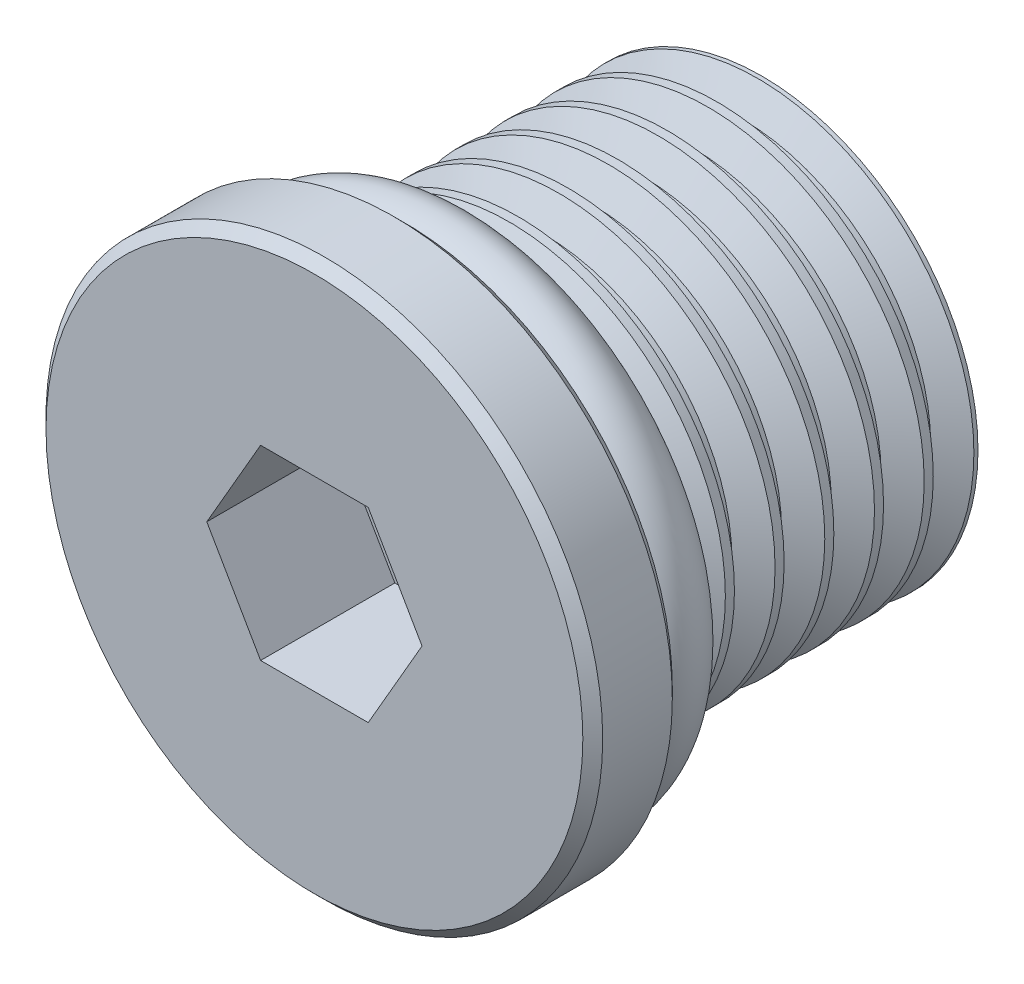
ISO-10303-21;
HEADER;
FILE_DESCRIPTION(('STEP AP214'),'2;1');
FILE_NAME('part.step','',(''),(''),'','','');
FILE_SCHEMA(('AUTOMOTIVE_DESIGN { 1 0 10303 214 1 1 1 1 }'));
ENDSEC;
DATA;
#1=APPLICATION_CONTEXT('core data for automotive mechanical design processes');
#2=APPLICATION_PROTOCOL_DEFINITION('international standard','automotive_design',2000,#1);
#3=PRODUCT_CONTEXT('',#1,'mechanical');
#4=PRODUCT('Part','Part','',(#3));
#5=PRODUCT_RELATED_PRODUCT_CATEGORY('part','',(#4));
#6=PRODUCT_DEFINITION_FORMATION('','',#4);
#7=PRODUCT_DEFINITION_CONTEXT('part definition',#1,'design');
#8=PRODUCT_DEFINITION('design','',#6,#7);
#9=PRODUCT_DEFINITION_SHAPE('','',#8);
#10=(LENGTH_UNIT() NAMED_UNIT(*) SI_UNIT(.MILLI.,.METRE.));
#11=(NAMED_UNIT(*) PLANE_ANGLE_UNIT() SI_UNIT($,.RADIAN.));
#12=(NAMED_UNIT(*) SI_UNIT($,.STERADIAN.) SOLID_ANGLE_UNIT());
#13=UNCERTAINTY_MEASURE_WITH_UNIT(LENGTH_MEASURE(1.E-05),#10,'distance_accuracy_value','');
#14=(GEOMETRIC_REPRESENTATION_CONTEXT(3) GLOBAL_UNCERTAINTY_ASSIGNED_CONTEXT((#13)) GLOBAL_UNIT_ASSIGNED_CONTEXT((#10,
#11,#12)) REPRESENTATION_CONTEXT('',''));
#15=CARTESIAN_POINT('',(0.,0.,0.));
#16=DIRECTION('',(0.,0.,1.));
#17=DIRECTION('',(1.,0.,0.));
#18=AXIS2_PLACEMENT_3D('',#15,#16,#17);
#19=CARTESIAN_POINT('',(0.,0.,-4.57199999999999));
#20=DIRECTION('',(0.,0.,1.));
#21=DIRECTION('',(1.,0.,0.));
#22=AXIS2_PLACEMENT_3D('',#19,#20,#21);
#23=CYLINDRICAL_SURFACE('',#22,4.826);
#24=CARTESIAN_POINT('',(0.,0.,-4.57199999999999));
#25=DIRECTION('',(0.,0.,-1.));
#26=DIRECTION('',(-1.,0.,0.));
#27=AXIS2_PLACEMENT_3D('',#24,#25,#26);
#28=CIRCLE('',#27,4.826);
#29=CARTESIAN_POINT('',(-4.826,0.,-4.57199999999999));
#30=VERTEX_POINT('',#29);
#31=EDGE_CURVE('E209',#30,#30,#28,.T.);
#32=ORIENTED_EDGE('',*,*,#31,.F.);
#33=EDGE_LOOP('',(#32));
#34=FACE_BOUND('',#33,.T.);
#35=CARTESIAN_POINT('',(0.,0.,-3.38902420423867));
#36=DIRECTION('',(0.,0.,1.));
#37=DIRECTION('',(1.,0.,0.));
#38=AXIS2_PLACEMENT_3D('',#35,#36,#37);
#39=CIRCLE('',#38,4.826);
#40=CARTESIAN_POINT('',(4.826,0.,-3.38902420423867));
#41=VERTEX_POINT('',#40);
#42=EDGE_CURVE('E229',#41,#41,#39,.T.);
#43=ORIENTED_EDGE('',*,*,#42,.F.);
#44=EDGE_LOOP('',(#43));
#45=FACE_BOUND('',#44,.T.);
#46=ADVANCED_FACE('F35',(#34,#45),#23,.T.);
#47=CARTESIAN_POINT('',(0.,0.,1.04119821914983));
#48=DIRECTION('',(0.,0.,1.));
#49=DIRECTION('',(1.,0.,0.));
#50=AXIS2_PLACEMENT_3D('',#47,#48,#49);
#51=CYLINDRICAL_SURFACE('',#50,5.5245);
#52=CARTESIAN_POINT('',(0.,0.,-11.325279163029));
#53=DIRECTION('',(0.,0.,1.));
#54=DIRECTION('',(1.,0.,0.));
#55=AXIS2_PLACEMENT_3D('',#52,#53,#54);
#56=CIRCLE('',#55,5.5245);
#57=CARTESIAN_POINT('',(5.5245,0.,-11.325279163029));
#58=VERTEX_POINT('',#57);
#59=EDGE_CURVE('E140',#58,#58,#56,.T.);
#60=ORIENTED_EDGE('',*,*,#59,.F.);
#61=EDGE_LOOP('',(#60));
#62=FACE_BOUND('',#61,.T.);
#63=CARTESIAN_POINT('',(0.,0.,-11.43));
#64=DIRECTION('',(0.,0.,-1.));
#65=DIRECTION('',(0.,1.,0.));
#66=AXIS2_PLACEMENT_3D('',#63,#64,#65);
#67=CIRCLE('',#66,5.5245);
#68=CARTESIAN_POINT('',(0.,5.52450000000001,-11.43));
#69=VERTEX_POINT('',#68);
#70=EDGE_CURVE('E215',#69,#69,#67,.T.);
#71=ORIENTED_EDGE('',*,*,#70,.F.);
#72=EDGE_LOOP('',(#71));
#73=FACE_BOUND('',#72,.T.);
#74=ADVANCED_FACE('F278',(#62,#73),#51,.T.);
#75=CARTESIAN_POINT('',(0.,0.,-4.97527916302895));
#76=DIRECTION('',(0.,0.,-1.));
#77=DIRECTION('',(-1.,0.,0.));
#78=AXIS2_PLACEMENT_3D('',#75,#76,#77);
#79=CONICAL_SURFACE('',#78,5.5245,1.0471975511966);
#80=ORIENTED_EDGE('',*,*,#31,.T.);
#81=EDGE_LOOP('',(#80));
#82=FACE_BOUND('',#81,.T.);
#83=CARTESIAN_POINT('',(0.,0.,-4.97527916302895));
#84=DIRECTION('',(0.,0.,1.));
#85=DIRECTION('',(1.,0.,0.));
#86=AXIS2_PLACEMENT_3D('',#83,#84,#85);
#87=CIRCLE('',#86,5.5245);
#88=CARTESIAN_POINT('',(5.52450000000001,0.,-4.97527916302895));
#89=VERTEX_POINT('',#88);
#90=EDGE_CURVE('E206',#89,#89,#87,.T.);
#91=ORIENTED_EDGE('',*,*,#90,.T.);
#92=EDGE_LOOP('',(#91));
#93=FACE_BOUND('',#92,.T.);
#94=ADVANCED_FACE('F283',(#82,#93),#79,.T.);
#95=CARTESIAN_POINT('',(0.,0.,1.04119821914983));
#96=DIRECTION('',(0.,0.,1.));
#97=DIRECTION('',(1.,0.,0.));
#98=AXIS2_PLACEMENT_3D('',#95,#96,#97);
#99=CYLINDRICAL_SURFACE('',#98,5.5245);
#100=ORIENTED_EDGE('',*,*,#90,.F.);
#101=EDGE_LOOP('',(#100));
#102=FACE_BOUND('',#101,.T.);
#103=CARTESIAN_POINT('',(0.,0.,-5.20699999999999));
#104=DIRECTION('',(0.,0.,1.));
#105=DIRECTION('',(1.,0.,0.));
#106=AXIS2_PLACEMENT_3D('',#103,#104,#105);
#107=CIRCLE('',#106,5.5245);
#108=CARTESIAN_POINT('',(5.52450000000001,0.,-5.20699999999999));
#109=VERTEX_POINT('',#108);
#110=EDGE_CURVE('E203',#109,#109,#107,.T.);
#111=ORIENTED_EDGE('',*,*,#110,.T.);
#112=EDGE_LOOP('',(#111));
#113=FACE_BOUND('',#112,.T.);
#114=ADVANCED_FACE('F385',(#102,#113),#99,.T.);
#115=CARTESIAN_POINT('',(0.,-1.11022302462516E-13,-5.61027916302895));
#116=DIRECTION('',(0.,0.,1.));
#117=DIRECTION('',(1.,0.,0.));
#118=AXIS2_PLACEMENT_3D('',#115,#116,#117);
#119=CONICAL_SURFACE('',#118,4.826,1.0471975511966);
#120=ORIENTED_EDGE('',*,*,#110,.F.);
#121=EDGE_LOOP('',(#120));
#122=FACE_BOUND('',#121,.T.);
#123=CARTESIAN_POINT('',(0.,-1.11022302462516E-13,-5.61027916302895));
#124=DIRECTION('',(0.,0.,1.));
#125=DIRECTION('',(1.,0.,0.));
#126=AXIS2_PLACEMENT_3D('',#123,#124,#125);
#127=CIRCLE('',#126,4.826);
#128=CARTESIAN_POINT('',(4.826,-1.04592778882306E-13,-5.61027916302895));
#129=VERTEX_POINT('',#128);
#130=EDGE_CURVE('E200',#129,#129,#127,.T.);
#131=ORIENTED_EDGE('',*,*,#130,.T.);
#132=EDGE_LOOP('',(#131));
#133=FACE_BOUND('',#132,.T.);
#134=ADVANCED_FACE('F382',(#122,#133),#119,.T.);
#135=CARTESIAN_POINT('',(0.,0.,1.04119821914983));
#136=DIRECTION('',(0.,0.,1.));
#137=DIRECTION('',(1.,0.,0.));
#138=AXIS2_PLACEMENT_3D('',#135,#136,#137);
#139=CYLINDRICAL_SURFACE('',#138,4.826);
#140=ORIENTED_EDGE('',*,*,#130,.F.);
#141=EDGE_LOOP('',(#140));
#142=FACE_BOUND('',#141,.T.);
#143=CARTESIAN_POINT('',(0.,-1.11022302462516E-13,-5.84199999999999));
#144=DIRECTION('',(0.,0.,1.));
#145=DIRECTION('',(1.,0.,0.));
#146=AXIS2_PLACEMENT_3D('',#143,#144,#145);
#147=CIRCLE('',#146,4.826);
#148=CARTESIAN_POINT('',(4.826,-1.04592778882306E-13,-5.84199999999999));
#149=VERTEX_POINT('',#148);
#150=EDGE_CURVE('E197',#149,#149,#147,.T.);
#151=ORIENTED_EDGE('',*,*,#150,.T.);
#152=EDGE_LOOP('',(#151));
#153=FACE_BOUND('',#152,.T.);
#154=ADVANCED_FACE('F378',(#142,#153),#139,.T.);
#155=CARTESIAN_POINT('',(0.,0.,-6.24527916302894));
#156=DIRECTION('',(0.,0.,-1.));
#157=DIRECTION('',(-1.,0.,0.));
#158=AXIS2_PLACEMENT_3D('',#155,#156,#157);
#159=CONICAL_SURFACE('',#158,5.5245,1.0471975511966);
#160=ORIENTED_EDGE('',*,*,#150,.F.);
#161=EDGE_LOOP('',(#160));
#162=FACE_BOUND('',#161,.T.);
#163=CARTESIAN_POINT('',(0.,0.,-6.24527916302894));
#164=DIRECTION('',(0.,0.,1.));
#165=DIRECTION('',(1.,0.,0.));
#166=AXIS2_PLACEMENT_3D('',#163,#164,#165);
#167=CIRCLE('',#166,5.5245);
#168=CARTESIAN_POINT('',(5.5245,0.,-6.24527916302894));
#169=VERTEX_POINT('',#168);
#170=EDGE_CURVE('E194',#169,#169,#167,.T.);
#171=ORIENTED_EDGE('',*,*,#170,.T.);
#172=EDGE_LOOP('',(#171));
#173=FACE_BOUND('',#172,.T.);
#174=ADVANCED_FACE('F374',(#162,#173),#159,.T.);
#175=CARTESIAN_POINT('',(0.,0.,1.04119821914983));
#176=DIRECTION('',(0.,0.,1.));
#177=DIRECTION('',(1.,0.,0.));
#178=AXIS2_PLACEMENT_3D('',#175,#176,#177);
#179=CYLINDRICAL_SURFACE('',#178,5.5245);
#180=ORIENTED_EDGE('',*,*,#170,.F.);
#181=EDGE_LOOP('',(#180));
#182=FACE_BOUND('',#181,.T.);
#183=CARTESIAN_POINT('',(0.,-1.11022302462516E-13,-6.47699999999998));
#184=DIRECTION('',(0.,0.,1.));
#185=DIRECTION('',(1.,0.,0.));
#186=AXIS2_PLACEMENT_3D('',#183,#184,#185);
#187=CIRCLE('',#186,5.5245);
#188=CARTESIAN_POINT('',(5.5245,-1.03662189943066E-13,-6.47699999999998));
#189=VERTEX_POINT('',#188);
#190=EDGE_CURVE('E191',#189,#189,#187,.T.);
#191=ORIENTED_EDGE('',*,*,#190,.T.);
#192=EDGE_LOOP('',(#191));
#193=FACE_BOUND('',#192,.T.);
#194=ADVANCED_FACE('F370',(#182,#193),#179,.T.);
#195=CARTESIAN_POINT('',(0.,-1.11022302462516E-13,-6.88027916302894));
#196=DIRECTION('',(0.,0.,1.));
#197=DIRECTION('',(1.,0.,0.));
#198=AXIS2_PLACEMENT_3D('',#195,#196,#197);
#199=CONICAL_SURFACE('',#198,4.826,1.0471975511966);
#200=ORIENTED_EDGE('',*,*,#190,.F.);
#201=EDGE_LOOP('',(#200));
#202=FACE_BOUND('',#201,.T.);
#203=CARTESIAN_POINT('',(0.,-1.11022302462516E-13,-6.88027916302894));
#204=DIRECTION('',(0.,0.,1.));
#205=DIRECTION('',(1.,0.,0.));
#206=AXIS2_PLACEMENT_3D('',#203,#204,#205);
#207=CIRCLE('',#206,4.826);
#208=CARTESIAN_POINT('',(4.826,-1.04592778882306E-13,-6.88027916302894));
#209=VERTEX_POINT('',#208);
#210=EDGE_CURVE('E188',#209,#209,#207,.T.);
#211=ORIENTED_EDGE('',*,*,#210,.T.);
#212=EDGE_LOOP('',(#211));
#213=FACE_BOUND('',#212,.T.);
#214=ADVANCED_FACE('F366',(#202,#213),#199,.T.);
#215=CARTESIAN_POINT('',(0.,0.,1.04119821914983));
#216=DIRECTION('',(0.,0.,1.));
#217=DIRECTION('',(1.,0.,0.));
#218=AXIS2_PLACEMENT_3D('',#215,#216,#217);
#219=CYLINDRICAL_SURFACE('',#218,4.826);
#220=ORIENTED_EDGE('',*,*,#210,.F.);
#221=EDGE_LOOP('',(#220));
#222=FACE_BOUND('',#221,.T.);
#223=CARTESIAN_POINT('',(0.,-1.11022302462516E-13,-7.11199999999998));
#224=DIRECTION('',(0.,0.,1.));
#225=DIRECTION('',(1.,0.,0.));
#226=AXIS2_PLACEMENT_3D('',#223,#224,#225);
#227=CIRCLE('',#226,4.826);
#228=CARTESIAN_POINT('',(4.826,-1.04592778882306E-13,-7.11199999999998));
#229=VERTEX_POINT('',#228);
#230=EDGE_CURVE('E185',#229,#229,#227,.T.);
#231=ORIENTED_EDGE('',*,*,#230,.T.);
#232=EDGE_LOOP('',(#231));
#233=FACE_BOUND('',#232,.T.);
#234=ADVANCED_FACE('F362',(#222,#233),#219,.T.);
#235=CARTESIAN_POINT('',(0.,-1.11022302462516E-13,-7.51527916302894));
#236=DIRECTION('',(0.,0.,-1.));
#237=DIRECTION('',(-1.,0.,0.));
#238=AXIS2_PLACEMENT_3D('',#235,#236,#237);
#239=CONICAL_SURFACE('',#238,5.5245,1.0471975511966);
#240=ORIENTED_EDGE('',*,*,#230,.F.);
#241=EDGE_LOOP('',(#240));
#242=FACE_BOUND('',#241,.T.);
#243=CARTESIAN_POINT('',(0.,-1.11022302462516E-13,-7.51527916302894));
#244=DIRECTION('',(0.,0.,1.));
#245=DIRECTION('',(1.,0.,0.));
#246=AXIS2_PLACEMENT_3D('',#243,#244,#245);
#247=CIRCLE('',#246,5.5245);
#248=CARTESIAN_POINT('',(5.5245,-1.03662189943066E-13,-7.51527916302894));
#249=VERTEX_POINT('',#248);
#250=EDGE_CURVE('E182',#249,#249,#247,.T.);
#251=ORIENTED_EDGE('',*,*,#250,.T.);
#252=EDGE_LOOP('',(#251));
#253=FACE_BOUND('',#252,.T.);
#254=ADVANCED_FACE('F358',(#242,#253),#239,.T.);
#255=CARTESIAN_POINT('',(0.,0.,1.04119821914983));
#256=DIRECTION('',(0.,0.,1.));
#257=DIRECTION('',(1.,0.,0.));
#258=AXIS2_PLACEMENT_3D('',#255,#256,#257);
#259=CYLINDRICAL_SURFACE('',#258,5.5245);
#260=ORIENTED_EDGE('',*,*,#250,.F.);
#261=EDGE_LOOP('',(#260));
#262=FACE_BOUND('',#261,.T.);
#263=CARTESIAN_POINT('',(0.,0.,-7.747));
#264=DIRECTION('',(0.,0.,1.));
#265=DIRECTION('',(1.,0.,0.));
#266=AXIS2_PLACEMENT_3D('',#263,#264,#265);
#267=CIRCLE('',#266,5.5245);
#268=CARTESIAN_POINT('',(5.5245,0.,-7.747));
#269=VERTEX_POINT('',#268);
#270=EDGE_CURVE('E179',#269,#269,#267,.T.);
#271=ORIENTED_EDGE('',*,*,#270,.T.);
#272=EDGE_LOOP('',(#271));
#273=FACE_BOUND('',#272,.T.);
#274=ADVANCED_FACE('F354',(#262,#273),#259,.T.);
#275=CARTESIAN_POINT('',(0.,0.,-8.15027916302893));
#276=DIRECTION('',(0.,0.,1.));
#277=DIRECTION('',(1.,0.,0.));
#278=AXIS2_PLACEMENT_3D('',#275,#276,#277);
#279=CONICAL_SURFACE('',#278,4.826,1.0471975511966);
#280=ORIENTED_EDGE('',*,*,#270,.F.);
#281=EDGE_LOOP('',(#280));
#282=FACE_BOUND('',#281,.T.);
#283=CARTESIAN_POINT('',(0.,0.,-8.15027916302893));
#284=DIRECTION('',(0.,0.,1.));
#285=DIRECTION('',(1.,0.,0.));
#286=AXIS2_PLACEMENT_3D('',#283,#284,#285);
#287=CIRCLE('',#286,4.826);
#288=CARTESIAN_POINT('',(4.826,0.,-8.15027916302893));
#289=VERTEX_POINT('',#288);
#290=EDGE_CURVE('E176',#289,#289,#287,.T.);
#291=ORIENTED_EDGE('',*,*,#290,.T.);
#292=EDGE_LOOP('',(#291));
#293=FACE_BOUND('',#292,.T.);
#294=ADVANCED_FACE('F350',(#282,#293),#279,.T.);
#295=CARTESIAN_POINT('',(0.,0.,1.04119821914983));
#296=DIRECTION('',(0.,0.,1.));
#297=DIRECTION('',(1.,0.,0.));
#298=AXIS2_PLACEMENT_3D('',#295,#296,#297);
#299=CYLINDRICAL_SURFACE('',#298,4.826);
#300=ORIENTED_EDGE('',*,*,#290,.F.);
#301=EDGE_LOOP('',(#300));
#302=FACE_BOUND('',#301,.T.);
#303=CARTESIAN_POINT('',(0.,0.,-8.382));
#304=DIRECTION('',(0.,0.,1.));
#305=DIRECTION('',(1.,0.,0.));
#306=AXIS2_PLACEMENT_3D('',#303,#304,#305);
#307=CIRCLE('',#306,4.82599999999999);
#308=CARTESIAN_POINT('',(4.826,0.,-8.382));
#309=VERTEX_POINT('',#308);
#310=EDGE_CURVE('E173',#309,#309,#307,.T.);
#311=ORIENTED_EDGE('',*,*,#310,.T.);
#312=EDGE_LOOP('',(#311));
#313=FACE_BOUND('',#312,.T.);
#314=ADVANCED_FACE('F346',(#302,#313),#299,.T.);
#315=CARTESIAN_POINT('',(0.,0.,-8.78527916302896));
#316=DIRECTION('',(0.,0.,-1.));
#317=DIRECTION('',(-1.,0.,0.));
#318=AXIS2_PLACEMENT_3D('',#315,#316,#317);
#319=CONICAL_SURFACE('',#318,5.5245,1.04719755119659);
#320=ORIENTED_EDGE('',*,*,#310,.F.);
#321=EDGE_LOOP('',(#320));
#322=FACE_BOUND('',#321,.T.);
#323=CARTESIAN_POINT('',(0.,0.,-8.78527916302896));
#324=DIRECTION('',(0.,0.,1.));
#325=DIRECTION('',(1.,0.,0.));
#326=AXIS2_PLACEMENT_3D('',#323,#324,#325);
#327=CIRCLE('',#326,5.5245);
#328=CARTESIAN_POINT('',(5.5245,0.,-8.78527916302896));
#329=VERTEX_POINT('',#328);
#330=EDGE_CURVE('E170',#329,#329,#327,.T.);
#331=ORIENTED_EDGE('',*,*,#330,.T.);
#332=EDGE_LOOP('',(#331));
#333=FACE_BOUND('',#332,.T.);
#334=ADVANCED_FACE('F342',(#322,#333),#319,.T.);
#335=CARTESIAN_POINT('',(0.,0.,1.04119821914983));
#336=DIRECTION('',(0.,0.,1.));
#337=DIRECTION('',(1.,0.,0.));
#338=AXIS2_PLACEMENT_3D('',#335,#336,#337);
#339=CYLINDRICAL_SURFACE('',#338,5.5245);
#340=ORIENTED_EDGE('',*,*,#330,.F.);
#341=EDGE_LOOP('',(#340));
#342=FACE_BOUND('',#341,.T.);
#343=CARTESIAN_POINT('',(0.,0.,-9.017));
#344=DIRECTION('',(0.,0.,1.));
#345=DIRECTION('',(1.,0.,0.));
#346=AXIS2_PLACEMENT_3D('',#343,#344,#345);
#347=CIRCLE('',#346,5.5245);
#348=CARTESIAN_POINT('',(5.5245,0.,-9.017));
#349=VERTEX_POINT('',#348);
#350=EDGE_CURVE('E167',#349,#349,#347,.T.);
#351=ORIENTED_EDGE('',*,*,#350,.T.);
#352=EDGE_LOOP('',(#351));
#353=FACE_BOUND('',#352,.T.);
#354=ADVANCED_FACE('F338',(#342,#353),#339,.T.);
#355=CARTESIAN_POINT('',(0.,0.,-9.42027916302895));
#356=DIRECTION('',(0.,0.,1.));
#357=DIRECTION('',(1.,0.,0.));
#358=AXIS2_PLACEMENT_3D('',#355,#356,#357);
#359=CONICAL_SURFACE('',#358,4.826,1.0471975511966);
#360=ORIENTED_EDGE('',*,*,#350,.F.);
#361=EDGE_LOOP('',(#360));
#362=FACE_BOUND('',#361,.T.);
#363=CARTESIAN_POINT('',(0.,0.,-9.42027916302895));
#364=DIRECTION('',(0.,0.,1.));
#365=DIRECTION('',(1.,0.,0.));
#366=AXIS2_PLACEMENT_3D('',#363,#364,#365);
#367=CIRCLE('',#366,4.826);
#368=CARTESIAN_POINT('',(4.826,0.,-9.42027916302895));
#369=VERTEX_POINT('',#368);
#370=EDGE_CURVE('E164',#369,#369,#367,.T.);
#371=ORIENTED_EDGE('',*,*,#370,.T.);
#372=EDGE_LOOP('',(#371));
#373=FACE_BOUND('',#372,.T.);
#374=ADVANCED_FACE('F334',(#362,#373),#359,.T.);
#375=CARTESIAN_POINT('',(0.,0.,1.04119821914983));
#376=DIRECTION('',(0.,0.,1.));
#377=DIRECTION('',(1.,0.,0.));
#378=AXIS2_PLACEMENT_3D('',#375,#376,#377);
#379=CYLINDRICAL_SURFACE('',#378,4.82599999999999);
#380=ORIENTED_EDGE('',*,*,#370,.F.);
#381=EDGE_LOOP('',(#380));
#382=FACE_BOUND('',#381,.T.);
#383=CARTESIAN_POINT('',(0.,0.,-9.65199999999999));
#384=DIRECTION('',(0.,0.,1.));
#385=DIRECTION('',(1.,0.,0.));
#386=AXIS2_PLACEMENT_3D('',#383,#384,#385);
#387=CIRCLE('',#386,4.82599999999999);
#388=CARTESIAN_POINT('',(4.826,0.,-9.65199999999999));
#389=VERTEX_POINT('',#388);
#390=EDGE_CURVE('E161',#389,#389,#387,.T.);
#391=ORIENTED_EDGE('',*,*,#390,.T.);
#392=EDGE_LOOP('',(#391));
#393=FACE_BOUND('',#392,.T.);
#394=ADVANCED_FACE('F330',(#382,#393),#379,.T.);
#395=CARTESIAN_POINT('',(0.,0.,-10.055279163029));
#396=DIRECTION('',(0.,0.,-1.));
#397=DIRECTION('',(-1.,0.,0.));
#398=AXIS2_PLACEMENT_3D('',#395,#396,#397);
#399=CONICAL_SURFACE('',#398,5.5245,1.0471975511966);
#400=ORIENTED_EDGE('',*,*,#390,.F.);
#401=EDGE_LOOP('',(#400));
#402=FACE_BOUND('',#401,.T.);
#403=CARTESIAN_POINT('',(0.,0.,-10.055279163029));
#404=DIRECTION('',(0.,0.,1.));
#405=DIRECTION('',(1.,0.,0.));
#406=AXIS2_PLACEMENT_3D('',#403,#404,#405);
#407=CIRCLE('',#406,5.5245);
#408=CARTESIAN_POINT('',(5.5245,0.,-10.055279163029));
#409=VERTEX_POINT('',#408);
#410=EDGE_CURVE('E158',#409,#409,#407,.T.);
#411=ORIENTED_EDGE('',*,*,#410,.T.);
#412=EDGE_LOOP('',(#411));
#413=FACE_BOUND('',#412,.T.);
#414=ADVANCED_FACE('F326',(#402,#413),#399,.T.);
#415=CARTESIAN_POINT('',(0.,0.,1.04119821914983));
#416=DIRECTION('',(0.,0.,1.));
#417=DIRECTION('',(1.,0.,0.));
#418=AXIS2_PLACEMENT_3D('',#415,#416,#417);
#419=CYLINDRICAL_SURFACE('',#418,5.5245);
#420=ORIENTED_EDGE('',*,*,#410,.F.);
#421=EDGE_LOOP('',(#420));
#422=FACE_BOUND('',#421,.T.);
#423=CARTESIAN_POINT('',(0.,0.,-10.287));
#424=DIRECTION('',(0.,0.,1.));
#425=DIRECTION('',(1.,0.,0.));
#426=AXIS2_PLACEMENT_3D('',#423,#424,#425);
#427=CIRCLE('',#426,5.5245);
#428=CARTESIAN_POINT('',(5.5245,0.,-10.287));
#429=VERTEX_POINT('',#428);
#430=EDGE_CURVE('E155',#429,#429,#427,.T.);
#431=ORIENTED_EDGE('',*,*,#430,.T.);
#432=EDGE_LOOP('',(#431));
#433=FACE_BOUND('',#432,.T.);
#434=ADVANCED_FACE('F322',(#422,#433),#419,.T.);
#435=CARTESIAN_POINT('',(0.,0.,-10.6902791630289));
#436=DIRECTION('',(0.,0.,1.));
#437=DIRECTION('',(1.,0.,0.));
#438=AXIS2_PLACEMENT_3D('',#435,#436,#437);
#439=CONICAL_SURFACE('',#438,4.826,1.0471975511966);
#440=ORIENTED_EDGE('',*,*,#430,.F.);
#441=EDGE_LOOP('',(#440));
#442=FACE_BOUND('',#441,.T.);
#443=CARTESIAN_POINT('',(0.,0.,-10.6902791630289));
#444=DIRECTION('',(0.,0.,1.));
#445=DIRECTION('',(1.,0.,0.));
#446=AXIS2_PLACEMENT_3D('',#443,#444,#445);
#447=CIRCLE('',#446,4.826);
#448=CARTESIAN_POINT('',(4.826,0.,-10.6902791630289));
#449=VERTEX_POINT('',#448);
#450=EDGE_CURVE('E152',#449,#449,#447,.T.);
#451=ORIENTED_EDGE('',*,*,#450,.T.);
#452=EDGE_LOOP('',(#451));
#453=FACE_BOUND('',#452,.T.);
#454=ADVANCED_FACE('F318',(#442,#453),#439,.T.);
#455=CARTESIAN_POINT('',(0.,0.,1.04119821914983));
#456=DIRECTION('',(0.,0.,1.));
#457=DIRECTION('',(1.,0.,0.));
#458=AXIS2_PLACEMENT_3D('',#455,#456,#457);
#459=CYLINDRICAL_SURFACE('',#458,4.82599999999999);
#460=ORIENTED_EDGE('',*,*,#450,.F.);
#461=EDGE_LOOP('',(#460));
#462=FACE_BOUND('',#461,.T.);
#463=CARTESIAN_POINT('',(0.,0.,-10.922));
#464=DIRECTION('',(0.,0.,1.));
#465=DIRECTION('',(1.,0.,0.));
#466=AXIS2_PLACEMENT_3D('',#463,#464,#465);
#467=CIRCLE('',#466,4.82599999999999);
#468=CARTESIAN_POINT('',(4.826,0.,-10.922));
#469=VERTEX_POINT('',#468);
#470=EDGE_CURVE('E149',#469,#469,#467,.T.);
#471=ORIENTED_EDGE('',*,*,#470,.T.);
#472=EDGE_LOOP('',(#471));
#473=FACE_BOUND('',#472,.T.);
#474=ADVANCED_FACE('F314',(#462,#473),#459,.T.);
#475=CARTESIAN_POINT('',(0.,0.,-11.325279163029));
#476=DIRECTION('',(0.,0.,-1.));
#477=DIRECTION('',(-1.,0.,0.));
#478=AXIS2_PLACEMENT_3D('',#475,#476,#477);
#479=CONICAL_SURFACE('',#478,5.5245,1.0471975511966);
#480=ORIENTED_EDGE('',*,*,#470,.F.);
#481=EDGE_LOOP('',(#480));
#482=FACE_BOUND('',#481,.T.);
#483=ORIENTED_EDGE('',*,*,#59,.T.);
#484=EDGE_LOOP('',(#483));
#485=FACE_BOUND('',#484,.T.);
#486=ADVANCED_FACE('F273',(#482,#485),#479,.T.);
#487=CARTESIAN_POINT('',(38.2926257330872,7.13288982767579,-11.43));
#488=DIRECTION('',(0.,0.,-1.));
#489=DIRECTION('',(0.,1.,0.));
#490=AXIS2_PLACEMENT_3D('',#487,#488,#489);
#491=PLANE('',#490);
#492=ORIENTED_EDGE('',*,*,#70,.T.);
#493=EDGE_LOOP('',(#492));
#494=FACE_BOUND('',#493,.T.);
#495=ADVANCED_FACE('F267',(#494),#491,.T.);
#496=CARTESIAN_POINT('',(0.,0.,-3.17500000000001));
#497=DIRECTION('',(0.,0.,1.));
#498=DIRECTION('',(1.,0.,0.));
#499=AXIS2_PLACEMENT_3D('',#496,#497,#498);
#500=TOROIDAL_SURFACE('',#499,5.715,0.9144);
#501=ORIENTED_EDGE('',*,*,#42,.T.);
#502=EDGE_LOOP('',(#501));
#503=FACE_BOUND('',#502,.T.);
#504=CARTESIAN_POINT('',(0.,0.,-2.28599999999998));
#505=DIRECTION('',(0.,0.,1.));
#506=DIRECTION('',(1.,0.,0.));
#507=AXIS2_PLACEMENT_3D('',#504,#505,#506);
#508=CIRCLE('',#507,5.92902420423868);
#509=CARTESIAN_POINT('',(5.92902420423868,0.,-2.28599999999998));
#510=VERTEX_POINT('',#509);
#511=EDGE_CURVE('E11',#510,#510,#508,.F.);
#512=ORIENTED_EDGE('',*,*,#511,.T.);
#513=EDGE_LOOP('',(#512));
#514=FACE_BOUND('',#513,.T.);
#515=ADVANCED_FACE('F261',(#503,#514),#500,.T.);
#516=CARTESIAN_POINT('',(2.7496306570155,-1.66533453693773E-13,-3.42899999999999));
#517=DIRECTION('',(0.,0.,1.));
#518=DIRECTION('',(1.,0.,0.));
#519=AXIS2_PLACEMENT_3D('',#516,#517,#518);
#520=PLANE('',#519);
#521=DIRECTION('',(0.500000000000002,0.866025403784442,0.));
#522=VECTOR('',#521,1.);
#523=CARTESIAN_POINT('',(1.37481532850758,-2.38125000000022,-3.42899999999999));
#524=LINE('',#523,#522);
#525=CARTESIAN_POINT('',(1.37481532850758,-2.38125000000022,-3.42899999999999));
#526=VERTEX_POINT('',#525);
#527=CARTESIAN_POINT('',(2.7496306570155,-1.66533453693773E-13,-3.42899999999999));
#528=VERTEX_POINT('',#527);
#529=EDGE_CURVE('E124',#526,#528,#524,.T.);
#530=ORIENTED_EDGE('',*,*,#529,.T.);
#531=DIRECTION('',(-0.5,0.86602540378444,0.));
#532=VECTOR('',#531,1.);
#533=CARTESIAN_POINT('',(2.7496306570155,-1.66533453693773E-13,-3.42899999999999));
#534=LINE('',#533,#532);
#535=CARTESIAN_POINT('',(1.37481532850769,2.38124999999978,-3.42899999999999));
#536=VERTEX_POINT('',#535);
#537=EDGE_CURVE('E127',#528,#536,#534,.T.);
#538=ORIENTED_EDGE('',*,*,#537,.T.);
#539=DIRECTION('',(-1.,0.,0.));
#540=VECTOR('',#539,1.);
#541=CARTESIAN_POINT('',(1.37481532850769,2.38124999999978,-3.42899999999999));
#542=LINE('',#541,#540);
#543=CARTESIAN_POINT('',(-1.37481532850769,2.38124999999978,-3.42899999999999));
#544=VERTEX_POINT('',#543);
#545=EDGE_CURVE('E98',#536,#544,#542,.T.);
#546=ORIENTED_EDGE('',*,*,#545,.T.);
#547=DIRECTION('',(-0.500000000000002,-0.866025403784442,0.));
#548=VECTOR('',#547,1.);
#549=CARTESIAN_POINT('',(-1.37481532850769,2.38124999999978,-3.42899999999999));
#550=LINE('',#549,#548);
#551=CARTESIAN_POINT('',(-2.74963065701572,-2.22044604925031E-13,-3.42899999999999));
#552=VERTEX_POINT('',#551);
#553=EDGE_CURVE('E130',#544,#552,#550,.T.);
#554=ORIENTED_EDGE('',*,*,#553,.T.);
#555=DIRECTION('',(0.5,-0.86602540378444,0.));
#556=VECTOR('',#555,1.);
#557=CARTESIAN_POINT('',(-2.74963065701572,-2.22044604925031E-13,-3.42899999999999));
#558=LINE('',#557,#556);
#559=CARTESIAN_POINT('',(-1.37481532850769,-2.38125,-3.42900000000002));
#560=VERTEX_POINT('',#559);
#561=EDGE_CURVE('E133',#552,#560,#558,.T.);
#562=ORIENTED_EDGE('',*,*,#561,.T.);
#563=DIRECTION('',(1.,0.,0.));
#564=VECTOR('',#563,1.);
#565=CARTESIAN_POINT('',(-1.37481532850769,-2.38125,-3.42900000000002));
#566=LINE('',#565,#564);
#567=EDGE_CURVE('E136',#560,#526,#566,.T.);
#568=ORIENTED_EDGE('',*,*,#567,.T.);
#569=EDGE_LOOP('',(#530,#538,#546,#554,#562,#568));
#570=FACE_BOUND('',#569,.T.);
#571=ADVANCED_FACE('F266',(#570),#520,.T.);
#572=CARTESIAN_POINT('',(2.7496306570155,-1.66533453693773E-13,-3.42899999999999));
#573=DIRECTION('',(0.866025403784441,0.500000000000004,0.));
#574=DIRECTION('',(-0.5,0.86602540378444,0.));
#575=AXIS2_PLACEMENT_3D('',#572,#573,#574);
#576=PLANE('',#575);
#577=DIRECTION('',(-0.5,0.86602540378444,0.));
#578=VECTOR('',#577,1.);
#579=CARTESIAN_POINT('',(2.74963065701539,-1.11022302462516E-13,0.));
#580=LINE('',#579,#578);
#581=CARTESIAN_POINT('',(2.74963065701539,-1.11022302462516E-13,0.));
#582=VERTEX_POINT('',#581);
#583=CARTESIAN_POINT('',(1.37481532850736,2.38124999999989,0.));
#584=VERTEX_POINT('',#583);
#585=EDGE_CURVE('E106',#582,#584,#580,.T.);
#586=ORIENTED_EDGE('',*,*,#585,.T.);
#587=DIRECTION('',(0.,0.,1.));
#588=VECTOR('',#587,1.);
#589=CARTESIAN_POINT('',(1.37481532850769,2.38124999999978,-3.42899999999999));
#590=LINE('',#589,#588);
#591=EDGE_CURVE('E91',#536,#584,#590,.T.);
#592=ORIENTED_EDGE('',*,*,#591,.F.);
#593=ORIENTED_EDGE('',*,*,#537,.F.);
#594=DIRECTION('',(0.,0.,1.));
#595=VECTOR('',#594,1.);
#596=CARTESIAN_POINT('',(2.7496306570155,-1.66533453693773E-13,-3.42899999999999));
#597=LINE('',#596,#595);
#598=EDGE_CURVE('E103',#528,#582,#597,.T.);
#599=ORIENTED_EDGE('',*,*,#598,.T.);
#600=EDGE_LOOP('',(#586,#592,#593,#599));
#601=FACE_BOUND('',#600,.T.);
#602=ADVANCED_FACE('F107',(#601),#576,.F.);
#603=CARTESIAN_POINT('',(1.37481532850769,2.38124999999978,-3.42899999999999));
#604=DIRECTION('',(0.,1.,0.));
#605=DIRECTION('',(0.,0.,1.));
#606=AXIS2_PLACEMENT_3D('',#603,#604,#605);
#607=PLANE('',#606);
#608=DIRECTION('',(-1.,0.,0.));
#609=VECTOR('',#608,1.);
#610=CARTESIAN_POINT('',(1.37481532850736,2.38124999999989,0.));
#611=LINE('',#610,#609);
#612=CARTESIAN_POINT('',(-1.37481532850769,2.38124999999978,0.));
#613=VERTEX_POINT('',#612);
#614=EDGE_CURVE('E95',#584,#613,#611,.T.);
#615=ORIENTED_EDGE('',*,*,#614,.T.);
#616=DIRECTION('',(0.,0.,1.));
#617=VECTOR('',#616,1.);
#618=CARTESIAN_POINT('',(-1.37481532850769,2.38124999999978,-3.42899999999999));
#619=LINE('',#618,#617);
#620=EDGE_CURVE('E102',#544,#613,#619,.T.);
#621=ORIENTED_EDGE('',*,*,#620,.F.);
#622=ORIENTED_EDGE('',*,*,#545,.F.);
#623=ORIENTED_EDGE('',*,*,#591,.T.);
#624=EDGE_LOOP('',(#615,#621,#622,#623));
#625=FACE_BOUND('',#624,.T.);
#626=ADVANCED_FACE('F93',(#625),#607,.F.);
#627=CARTESIAN_POINT('',(-1.37481532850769,2.38124999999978,-3.42899999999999));
#628=DIRECTION('',(-0.86602540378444,0.5,0.));
#629=DIRECTION('',(-0.500000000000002,-0.866025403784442,0.));
#630=AXIS2_PLACEMENT_3D('',#627,#628,#629);
#631=PLANE('',#630);
#632=DIRECTION('',(-0.500000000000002,-0.866025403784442,0.));
#633=VECTOR('',#632,1.);
#634=CARTESIAN_POINT('',(-1.37481532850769,2.38124999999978,0.));
#635=LINE('',#634,#633);
#636=CARTESIAN_POINT('',(-2.74963065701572,-2.22044604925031E-13,0.));
#637=VERTEX_POINT('',#636);
#638=EDGE_CURVE('E114',#613,#637,#635,.T.);
#639=ORIENTED_EDGE('',*,*,#638,.T.);
#640=DIRECTION('',(0.,0.,1.));
#641=VECTOR('',#640,1.);
#642=CARTESIAN_POINT('',(-2.74963065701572,-2.22044604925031E-13,-3.42899999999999));
#643=LINE('',#642,#641);
#644=EDGE_CURVE('E143',#552,#637,#643,.T.);
#645=ORIENTED_EDGE('',*,*,#644,.F.);
#646=ORIENTED_EDGE('',*,*,#553,.F.);
#647=ORIENTED_EDGE('',*,*,#620,.T.);
#648=EDGE_LOOP('',(#639,#645,#646,#647));
#649=FACE_BOUND('',#648,.T.);
#650=ADVANCED_FACE('F497',(#649),#631,.F.);
#651=CARTESIAN_POINT('',(-2.74963065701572,-2.22044604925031E-13,-3.42899999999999));
#652=DIRECTION('',(-0.866025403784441,-0.500000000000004,0.));
#653=DIRECTION('',(0.5,-0.86602540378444,0.));
#654=AXIS2_PLACEMENT_3D('',#651,#652,#653);
#655=PLANE('',#654);
#656=DIRECTION('',(0.5,-0.86602540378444,0.));
#657=VECTOR('',#656,1.);
#658=CARTESIAN_POINT('',(-2.74963065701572,-2.22044604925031E-13,0.));
#659=LINE('',#658,#657);
#660=CARTESIAN_POINT('',(-1.37481532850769,-2.38125,0.));
#661=VERTEX_POINT('',#660);
#662=EDGE_CURVE('E116',#637,#661,#659,.T.);
#663=ORIENTED_EDGE('',*,*,#662,.T.);
#664=DIRECTION('',(0.,0.,1.));
#665=VECTOR('',#664,1.);
#666=CARTESIAN_POINT('',(-1.37481532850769,-2.38125,-3.42900000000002));
#667=LINE('',#666,#665);
#668=EDGE_CURVE('E141',#560,#661,#667,.T.);
#669=ORIENTED_EDGE('',*,*,#668,.F.);
#670=ORIENTED_EDGE('',*,*,#561,.F.);
#671=ORIENTED_EDGE('',*,*,#644,.T.);
#672=EDGE_LOOP('',(#663,#669,#670,#671));
#673=FACE_BOUND('',#672,.T.);
#674=ADVANCED_FACE('F304',(#673),#655,.F.);
#675=CARTESIAN_POINT('',(-1.37481532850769,-2.38125,-3.42900000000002));
#676=DIRECTION('',(0.,-1.,0.));
#677=DIRECTION('',(0.,0.,-1.));
#678=AXIS2_PLACEMENT_3D('',#675,#676,#677);
#679=PLANE('',#678);
#680=DIRECTION('',(1.,0.,0.));
#681=VECTOR('',#680,1.);
#682=CARTESIAN_POINT('',(-1.37481532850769,-2.38125,0.));
#683=LINE('',#682,#681);
#684=CARTESIAN_POINT('',(1.37481532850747,-2.38125000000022,0.));
#685=VERTEX_POINT('',#684);
#686=EDGE_CURVE('E122',#661,#685,#683,.T.);
#687=ORIENTED_EDGE('',*,*,#686,.T.);
#688=DIRECTION('',(0.,0.,1.));
#689=VECTOR('',#688,1.);
#690=CARTESIAN_POINT('',(1.37481532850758,-2.38125000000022,-3.42899999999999));
#691=LINE('',#690,#689);
#692=EDGE_CURVE('E59',#526,#685,#691,.T.);
#693=ORIENTED_EDGE('',*,*,#692,.F.);
#694=ORIENTED_EDGE('',*,*,#567,.F.);
#695=ORIENTED_EDGE('',*,*,#668,.T.);
#696=EDGE_LOOP('',(#687,#693,#694,#695));
#697=FACE_BOUND('',#696,.T.);
#698=ADVANCED_FACE('F299',(#697),#679,.F.);
#699=CARTESIAN_POINT('',(1.37481532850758,-2.38125000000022,-3.42899999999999));
#700=DIRECTION('',(0.86602540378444,-0.5,0.));
#701=DIRECTION('',(0.500000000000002,0.866025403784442,0.));
#702=AXIS2_PLACEMENT_3D('',#699,#700,#701);
#703=PLANE('',#702);
#704=DIRECTION('',(0.500000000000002,0.866025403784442,0.));
#705=VECTOR('',#704,1.);
#706=CARTESIAN_POINT('',(1.37481532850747,-2.38125000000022,0.));
#707=LINE('',#706,#705);
#708=EDGE_CURVE('E52',#685,#582,#707,.T.);
#709=ORIENTED_EDGE('',*,*,#708,.T.);
#710=ORIENTED_EDGE('',*,*,#598,.F.);
#711=ORIENTED_EDGE('',*,*,#529,.F.);
#712=ORIENTED_EDGE('',*,*,#692,.T.);
#713=EDGE_LOOP('',(#709,#710,#711,#712));
#714=FACE_BOUND('',#713,.T.);
#715=ADVANCED_FACE('F292',(#714),#703,.F.);
#716=CARTESIAN_POINT('',(0.,0.,0.));
#717=DIRECTION('',(0.,0.,1.));
#718=DIRECTION('',(1.,0.,0.));
#719=AXIS2_PLACEMENT_3D('',#716,#717,#718);
#720=PLANE('',#719);
#721=ORIENTED_EDGE('',*,*,#708,.F.);
#722=ORIENTED_EDGE('',*,*,#686,.F.);
#723=ORIENTED_EDGE('',*,*,#662,.F.);
#724=ORIENTED_EDGE('',*,*,#638,.F.);
#725=ORIENTED_EDGE('',*,*,#614,.F.);
#726=ORIENTED_EDGE('',*,*,#585,.F.);
#727=EDGE_LOOP('',(#721,#722,#723,#724,#725,#726));
#728=FACE_BOUND('',#727,.T.);
#729=CARTESIAN_POINT('',(0.,0.,0.));
#730=DIRECTION('',(0.,0.,1.));
#731=DIRECTION('',(1.,0.,0.));
#732=AXIS2_PLACEMENT_3D('',#729,#730,#731);
#733=CIRCLE('',#732,6.858);
#734=CARTESIAN_POINT('',(6.85800000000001,0.,0.));
#735=VERTEX_POINT('',#734);
#736=EDGE_CURVE('E227',#735,#735,#733,.T.);
#737=ORIENTED_EDGE('',*,*,#736,.T.);
#738=EDGE_LOOP('',(#737));
#739=FACE_BOUND('',#738,.T.);
#740=ADVANCED_FACE('F110',(#728,#739),#720,.T.);
#741=CARTESIAN_POINT('',(0.,0.,0.));
#742=DIRECTION('',(0.,0.,-1.));
#743=DIRECTION('',(-1.,0.,0.));
#744=AXIS2_PLACEMENT_3D('',#741,#742,#743);
#745=CONICAL_SURFACE('',#744,6.858,0.785398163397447);
#746=CARTESIAN_POINT('',(0.,0.,-0.254000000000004));
#747=DIRECTION('',(0.,0.,1.));
#748=DIRECTION('',(1.,0.,0.));
#749=AXIS2_PLACEMENT_3D('',#746,#747,#748);
#750=CIRCLE('',#749,7.112);
#751=CARTESIAN_POINT('',(7.11200000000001,0.,-0.254000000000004));
#752=VERTEX_POINT('',#751);
#753=EDGE_CURVE('E218',#752,#752,#750,.F.);
#754=ORIENTED_EDGE('',*,*,#753,.F.);
#755=EDGE_LOOP('',(#754));
#756=FACE_BOUND('',#755,.T.);
#757=ORIENTED_EDGE('',*,*,#736,.F.);
#758=EDGE_LOOP('',(#757));
#759=FACE_BOUND('',#758,.T.);
#760=ADVANCED_FACE('F291',(#756,#759),#745,.T.);
#761=CARTESIAN_POINT('',(0.,0.,-2.28599999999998));
#762=DIRECTION('',(0.,0.,1.));
#763=DIRECTION('',(1.,0.,0.));
#764=AXIS2_PLACEMENT_3D('',#761,#762,#763);
#765=CYLINDRICAL_SURFACE('',#764,7.112);
#766=CARTESIAN_POINT('',(0.,0.,-2.03200000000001));
#767=DIRECTION('',(0.,0.,1.));
#768=DIRECTION('',(1.,0.,0.));
#769=AXIS2_PLACEMENT_3D('',#766,#767,#768);
#770=CIRCLE('',#769,7.112);
#771=CARTESIAN_POINT('',(7.11200000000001,0.,-2.03200000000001));
#772=VERTEX_POINT('',#771);
#773=EDGE_CURVE('E221',#772,#772,#770,.T.);
#774=ORIENTED_EDGE('',*,*,#773,.T.);
#775=EDGE_LOOP('',(#774));
#776=FACE_BOUND('',#775,.T.);
#777=ORIENTED_EDGE('',*,*,#753,.T.);
#778=EDGE_LOOP('',(#777));
#779=FACE_BOUND('',#778,.T.);
#780=ADVANCED_FACE('F37',(#776,#779),#765,.T.);
#781=CARTESIAN_POINT('',(0.,0.,-2.03200000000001));
#782=DIRECTION('',(0.,0.,1.));
#783=DIRECTION('',(1.,0.,0.));
#784=AXIS2_PLACEMENT_3D('',#781,#782,#783);
#785=CONICAL_SURFACE('',#784,7.112,0.785398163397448);
#786=CARTESIAN_POINT('',(0.,0.,-2.28599999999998));
#787=DIRECTION('',(0.,0.,1.));
#788=DIRECTION('',(1.,0.,0.));
#789=AXIS2_PLACEMENT_3D('',#786,#787,#788);
#790=CIRCLE('',#789,6.858);
#791=CARTESIAN_POINT('',(6.85800000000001,0.,-2.28599999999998));
#792=VERTEX_POINT('',#791);
#793=EDGE_CURVE('E224',#792,#792,#790,.F.);
#794=ORIENTED_EDGE('',*,*,#793,.F.);
#795=EDGE_LOOP('',(#794));
#796=FACE_BOUND('',#795,.T.);
#797=ORIENTED_EDGE('',*,*,#773,.F.);
#798=EDGE_LOOP('',(#797));
#799=FACE_BOUND('',#798,.T.);
#800=ADVANCED_FACE('F256',(#796,#799),#785,.T.);
#801=CARTESIAN_POINT('',(0.,0.,-2.28599999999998));
#802=DIRECTION('',(0.,0.,1.));
#803=DIRECTION('',(1.,0.,0.));
#804=AXIS2_PLACEMENT_3D('',#801,#802,#803);
#805=PLANE('',#804);
#806=ORIENTED_EDGE('',*,*,#793,.T.);
#807=EDGE_LOOP('',(#806));
#808=FACE_BOUND('',#807,.T.);
#809=ORIENTED_EDGE('',*,*,#511,.F.);
#810=EDGE_LOOP('',(#809));
#811=FACE_BOUND('',#810,.T.);
#812=ADVANCED_FACE('F246',(#808,#811),#805,.F.);
#813=CLOSED_SHELL('',(#46,#74,#94,#114,#134,#154,#174,#194,#214,#234,#254,#274,#294,#314,#334,
#354,#374,#394,#414,#434,#454,#474,#486,#495,#515,#571,#602,#626,#650,#674,#698,#715,#740,#760,
#780,#800,#812));
#814=CARTESIAN_POINT('',(0.,0.,-2.96097579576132));
#815=DIRECTION('',(0.,0.,-1.));
#816=DIRECTION('',(-1.,0.,0.));
#817=AXIS2_PLACEMENT_3D('',#814,#815,#816);
#818=CIRCLE('',#817,4.826);
#819=CARTESIAN_POINT('',(-4.826,0.,-2.96097579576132));
#820=VERTEX_POINT('',#819);
#821=EDGE_CURVE('E39',#820,#820,#818,.T.);
#822=ORIENTED_EDGE('',*,*,#821,.T.);
#823=EDGE_LOOP('',(#822));
#824=FACE_BOUND('',#823,.T.);
#825=CARTESIAN_POINT('',(0.,0.,-2.28599999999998));
#826=DIRECTION('',(0.,0.,-1.));
#827=DIRECTION('',(-1.,0.,0.));
#828=AXIS2_PLACEMENT_3D('',#825,#826,#827);
#829=CIRCLE('',#828,5.50097579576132);
#830=CARTESIAN_POINT('',(-5.50097579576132,0.,-2.28599999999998));
#831=VERTEX_POINT('',#830);
#832=EDGE_CURVE('E44',#831,#831,#829,.F.);
#833=ORIENTED_EDGE('',*,*,#832,.T.);
#834=EDGE_LOOP('',(#833));
#835=FACE_BOUND('',#834,.T.);
#836=ADVANCED_FACE('F240',(#824,#835),#500,.T.);
#837=CARTESIAN_POINT('',(0.,0.,-2.28599999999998));
#838=DIRECTION('',(0.,0.,1.));
#839=DIRECTION('',(1.,0.,0.));
#840=AXIS2_PLACEMENT_3D('',#837,#838,#839);
#841=CIRCLE('',#840,4.826);
#842=CARTESIAN_POINT('',(4.826,0.,-2.28599999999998));
#843=VERTEX_POINT('',#842);
#844=EDGE_CURVE('E212',#843,#843,#841,.F.);
#845=ORIENTED_EDGE('',*,*,#844,.T.);
#846=EDGE_LOOP('',(#845));
#847=FACE_BOUND('',#846,.T.);
#848=ORIENTED_EDGE('',*,*,#821,.F.);
#849=EDGE_LOOP('',(#848));
#850=FACE_BOUND('',#849,.T.);
#851=ADVANCED_FACE('F244',(#847,#850),#23,.T.);
#852=ORIENTED_EDGE('',*,*,#844,.F.);
#853=EDGE_LOOP('',(#852));
#854=FACE_BOUND('',#853,.T.);
#855=ORIENTED_EDGE('',*,*,#832,.F.);
#856=EDGE_LOOP('',(#855));
#857=FACE_BOUND('',#856,.T.);
#858=ADVANCED_FACE('F242',(#854,#857),#805,.F.);
#859=CLOSED_SHELL('',(#836,#851,#858));
#860=ORIENTED_CLOSED_SHELL('',*,#859,.T.);
#861=BREP_WITH_VOIDS('B2',#813,(#860));
#862=ADVANCED_BREP_SHAPE_REPRESENTATION('',(#18,#861),#14);
#863=SHAPE_DEFINITION_REPRESENTATION(#9,#862);
ENDSEC;
END-ISO-10303-21;
